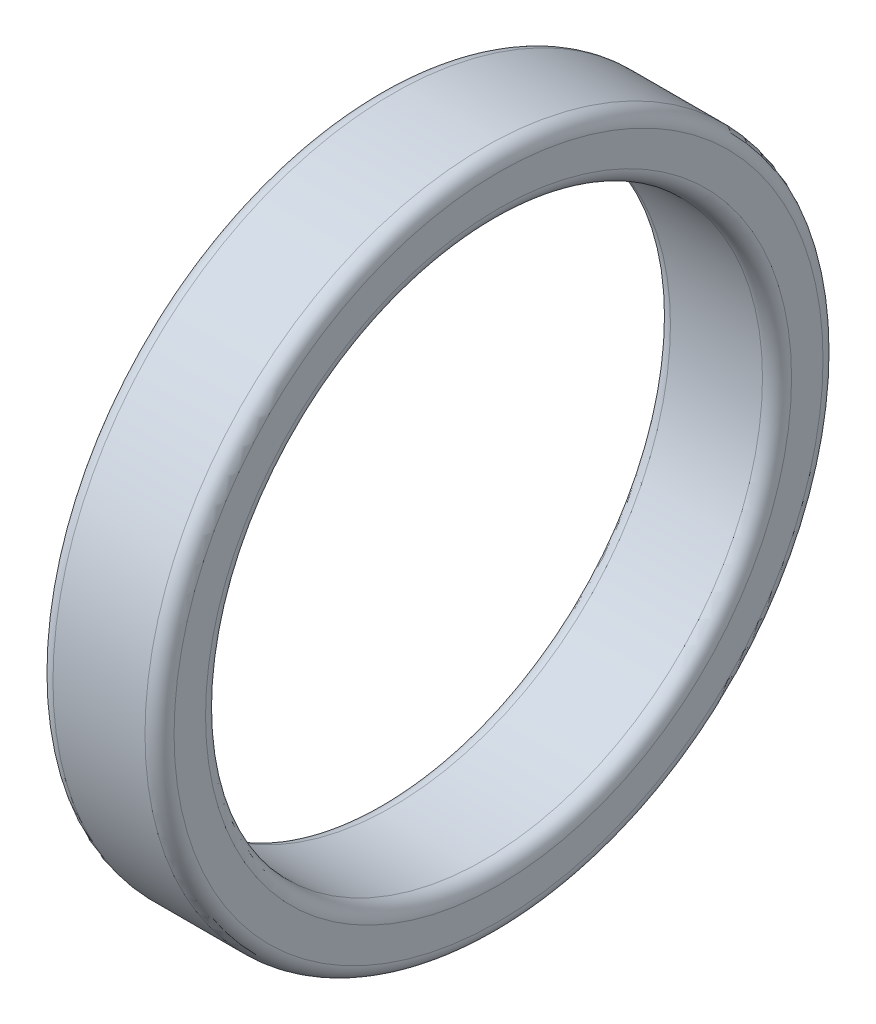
from build123d import *


with BuildPart() as part:
    # Esquisse1 → Base-R_volution (revolve)
    with BuildSketch(Plane.XY, mode=Mode.PRIVATE) as base_r_volution_sk:
        with BuildLine():
            Line((-0.3, 7), (-2.2, 7))
            ThreePointArc((-2.2, 7), (-2.412132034, 6.912132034), (-2.5, 6.7))
            Line((-2.5, 6.7), (-2.5, 6.05))
            ThreePointArc((-2.5, 6.05), (-2.412132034, 5.837867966), (-2.2, 5.75))
            Line((-2.2, 5.75), (-0.3, 5.75))
            ThreePointArc((-0.3, 5.75), (-0.087867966, 5.837867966), (0, 6.05))
            Line((0, 6.05), (0, 6.7))
            ThreePointArc((0, 6.7), (-0.087867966, 6.912132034), (-0.3, 7))
        make_face()
    revolve(base_r_volution_sk.sketch.rotate(Axis((-7.5, 0, 0), (1, 0, 0)), 90), axis=Axis((-7.5, 0, 0), (1, 0, 0)))


solid = part.part
